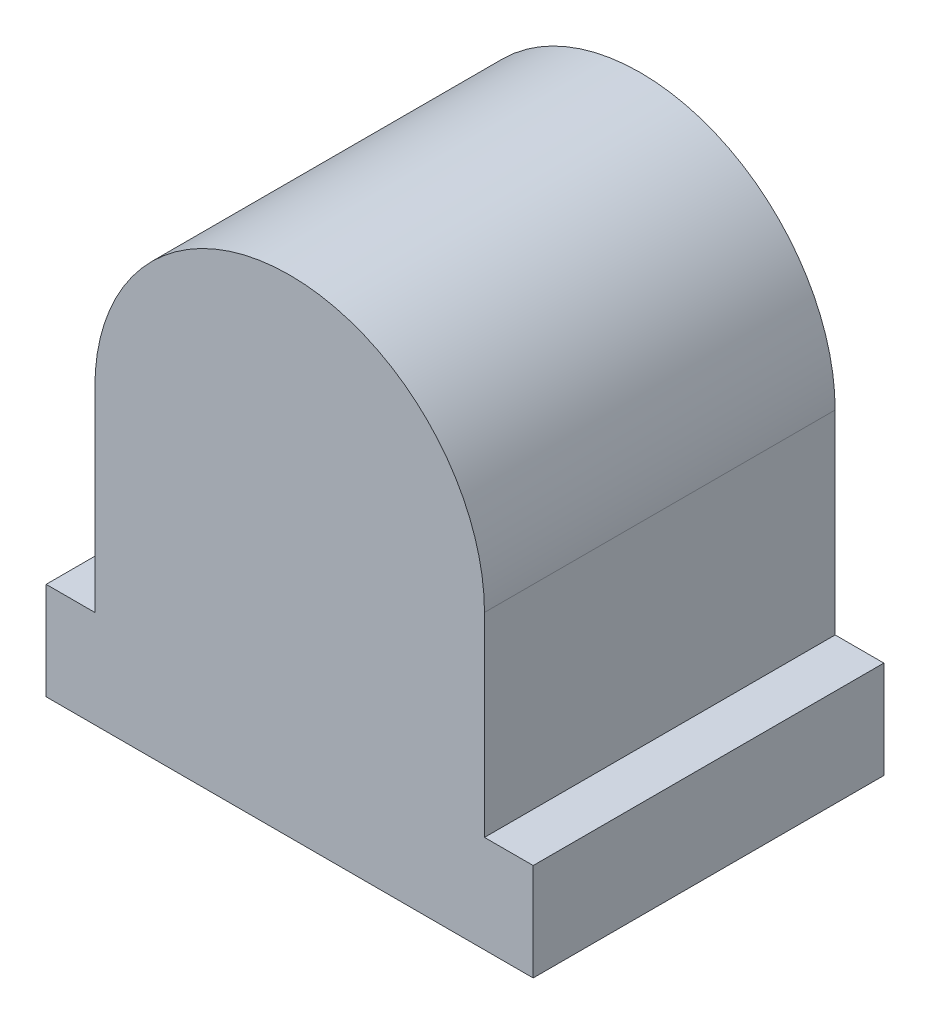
ISO-10303-21;
HEADER;
FILE_DESCRIPTION(('STEP AP214'),'2;1');
FILE_NAME('part.step','',(''),(''),'','','');
FILE_SCHEMA(('AUTOMOTIVE_DESIGN { 1 0 10303 214 1 1 1 1 }'));
ENDSEC;
DATA;
#1=APPLICATION_CONTEXT('core data for automotive mechanical design processes');
#2=APPLICATION_PROTOCOL_DEFINITION('international standard','automotive_design',2000,#1);
#3=PRODUCT_CONTEXT('',#1,'mechanical');
#4=PRODUCT('Part','Part','',(#3));
#5=PRODUCT_RELATED_PRODUCT_CATEGORY('part','',(#4));
#6=PRODUCT_DEFINITION_FORMATION('','',#4);
#7=PRODUCT_DEFINITION_CONTEXT('part definition',#1,'design');
#8=PRODUCT_DEFINITION('design','',#6,#7);
#9=PRODUCT_DEFINITION_SHAPE('','',#8);
#10=(LENGTH_UNIT() NAMED_UNIT(*) SI_UNIT(.MILLI.,.METRE.));
#11=(NAMED_UNIT(*) PLANE_ANGLE_UNIT() SI_UNIT($,.RADIAN.));
#12=(NAMED_UNIT(*) SI_UNIT($,.STERADIAN.) SOLID_ANGLE_UNIT());
#13=UNCERTAINTY_MEASURE_WITH_UNIT(LENGTH_MEASURE(1.E-05),#10,'distance_accuracy_value','');
#14=(GEOMETRIC_REPRESENTATION_CONTEXT(3) GLOBAL_UNCERTAINTY_ASSIGNED_CONTEXT((#13)) GLOBAL_UNIT_ASSIGNED_CONTEXT((#10,
#11,#12)) REPRESENTATION_CONTEXT('',''));
#15=CARTESIAN_POINT('',(0.,0.,0.));
#16=DIRECTION('',(0.,0.,1.));
#17=DIRECTION('',(1.,0.,0.));
#18=AXIS2_PLACEMENT_3D('',#15,#16,#17);
#19=CARTESIAN_POINT('',(0.,16.1907152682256,36.));
#20=DIRECTION('',(0.,0.,-1.));
#21=DIRECTION('',(-1.,0.,0.));
#22=AXIS2_PLACEMENT_3D('',#19,#20,#21);
#23=CYLINDRICAL_SURFACE('',#22,20.);
#24=CARTESIAN_POINT('',(0.,16.1907152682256,0.));
#25=DIRECTION('',(0.,0.,1.));
#26=DIRECTION('',(1.,0.,0.));
#27=AXIS2_PLACEMENT_3D('',#24,#25,#26);
#28=CIRCLE('',#27,20.);
#29=CARTESIAN_POINT('',(20.,16.1907152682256,0.));
#30=VERTEX_POINT('',#29);
#31=CARTESIAN_POINT('',(-20.,16.1907152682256,0.));
#32=VERTEX_POINT('',#31);
#33=EDGE_CURVE('E127',#30,#32,#28,.T.);
#34=ORIENTED_EDGE('',*,*,#33,.T.);
#35=DIRECTION('',(0.,0.,-1.));
#36=VECTOR('',#35,1.);
#37=CARTESIAN_POINT('',(-20.,16.1907152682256,36.));
#38=LINE('',#37,#36);
#39=CARTESIAN_POINT('',(-20.,16.1907152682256,36.));
#40=VERTEX_POINT('',#39);
#41=EDGE_CURVE('E11',#40,#32,#38,.T.);
#42=ORIENTED_EDGE('',*,*,#41,.F.);
#43=CARTESIAN_POINT('',(0.,16.1907152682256,36.));
#44=DIRECTION('',(0.,0.,1.));
#45=DIRECTION('',(1.,0.,0.));
#46=AXIS2_PLACEMENT_3D('',#43,#44,#45);
#47=CIRCLE('',#46,20.);
#48=CARTESIAN_POINT('',(20.,16.1907152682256,36.));
#49=VERTEX_POINT('',#48);
#50=EDGE_CURVE('E141',#49,#40,#47,.T.);
#51=ORIENTED_EDGE('',*,*,#50,.F.);
#52=DIRECTION('',(0.,0.,-1.));
#53=VECTOR('',#52,1.);
#54=CARTESIAN_POINT('',(20.,16.1907152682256,36.));
#55=LINE('',#54,#53);
#56=EDGE_CURVE('E123',#49,#30,#55,.T.);
#57=ORIENTED_EDGE('',*,*,#56,.T.);
#58=EDGE_LOOP('',(#34,#42,#51,#57));
#59=FACE_BOUND('',#58,.T.);
#60=ADVANCED_FACE('F31',(#59),#23,.T.);
#61=CARTESIAN_POINT('',(-20.,16.1907152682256,36.));
#62=DIRECTION('',(1.,0.,0.));
#63=DIRECTION('',(0.,1.,0.));
#64=AXIS2_PLACEMENT_3D('',#61,#62,#63);
#65=PLANE('',#64);
#66=DIRECTION('',(0.,-1.,0.));
#67=VECTOR('',#66,1.);
#68=CARTESIAN_POINT('',(-20.,16.1907152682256,0.));
#69=LINE('',#68,#67);
#70=CARTESIAN_POINT('',(-20.,-3.80928473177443,0.));
#71=VERTEX_POINT('',#70);
#72=EDGE_CURVE('E130',#32,#71,#69,.T.);
#73=ORIENTED_EDGE('',*,*,#72,.T.);
#74=DIRECTION('',(0.,0.,-1.));
#75=VECTOR('',#74,1.);
#76=CARTESIAN_POINT('',(-20.,-3.80928473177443,36.));
#77=LINE('',#76,#75);
#78=CARTESIAN_POINT('',(-20.,-3.80928473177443,36.));
#79=VERTEX_POINT('',#78);
#80=EDGE_CURVE('E39',#79,#71,#77,.T.);
#81=ORIENTED_EDGE('',*,*,#80,.F.);
#82=DIRECTION('',(0.,-1.,0.));
#83=VECTOR('',#82,1.);
#84=CARTESIAN_POINT('',(-20.,16.1907152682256,36.));
#85=LINE('',#84,#83);
#86=EDGE_CURVE('E90',#40,#79,#85,.T.);
#87=ORIENTED_EDGE('',*,*,#86,.F.);
#88=ORIENTED_EDGE('',*,*,#41,.T.);
#89=EDGE_LOOP('',(#73,#81,#87,#88));
#90=FACE_BOUND('',#89,.T.);
#91=ADVANCED_FACE('F176',(#90),#65,.F.);
#92=CARTESIAN_POINT('',(-20.,-3.80928473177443,36.));
#93=DIRECTION('',(0.,-1.,0.));
#94=DIRECTION('',(1.,0.,0.));
#95=AXIS2_PLACEMENT_3D('',#92,#93,#94);
#96=PLANE('',#95);
#97=DIRECTION('',(-1.,0.,0.));
#98=VECTOR('',#97,1.);
#99=CARTESIAN_POINT('',(-20.,-3.80928473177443,0.));
#100=LINE('',#99,#98);
#101=CARTESIAN_POINT('',(-25.,-3.80928473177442,0.));
#102=VERTEX_POINT('',#101);
#103=EDGE_CURVE('E132',#71,#102,#100,.T.);
#104=ORIENTED_EDGE('',*,*,#103,.T.);
#105=DIRECTION('',(0.,0.,-1.));
#106=VECTOR('',#105,1.);
#107=CARTESIAN_POINT('',(-25.,-3.80928473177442,36.));
#108=LINE('',#107,#106);
#109=CARTESIAN_POINT('',(-25.,-3.80928473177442,36.));
#110=VERTEX_POINT('',#109);
#111=EDGE_CURVE('E148',#110,#102,#108,.T.);
#112=ORIENTED_EDGE('',*,*,#111,.F.);
#113=DIRECTION('',(-1.,0.,0.));
#114=VECTOR('',#113,1.);
#115=CARTESIAN_POINT('',(-20.,-3.80928473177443,36.));
#116=LINE('',#115,#114);
#117=EDGE_CURVE('E156',#79,#110,#116,.T.);
#118=ORIENTED_EDGE('',*,*,#117,.F.);
#119=ORIENTED_EDGE('',*,*,#80,.T.);
#120=EDGE_LOOP('',(#104,#112,#118,#119));
#121=FACE_BOUND('',#120,.T.);
#122=ADVANCED_FACE('F154',(#121),#96,.F.);
#123=CARTESIAN_POINT('',(-25.,-3.80928473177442,36.));
#124=DIRECTION('',(1.,0.,0.));
#125=DIRECTION('',(0.,0.,-1.));
#126=AXIS2_PLACEMENT_3D('',#123,#124,#125);
#127=PLANE('',#126);
#128=DIRECTION('',(0.,-1.,0.));
#129=VECTOR('',#128,1.);
#130=CARTESIAN_POINT('',(-25.,-3.80928473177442,0.));
#131=LINE('',#130,#129);
#132=CARTESIAN_POINT('',(-25.,-13.8092847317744,0.));
#133=VERTEX_POINT('',#132);
#134=EDGE_CURVE('E134',#102,#133,#131,.T.);
#135=ORIENTED_EDGE('',*,*,#134,.T.);
#136=DIRECTION('',(0.,0.,-1.));
#137=VECTOR('',#136,1.);
#138=CARTESIAN_POINT('',(-25.,-13.8092847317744,36.));
#139=LINE('',#138,#137);
#140=CARTESIAN_POINT('',(-25.,-13.8092847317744,36.));
#141=VERTEX_POINT('',#140);
#142=EDGE_CURVE('E145',#141,#133,#139,.T.);
#143=ORIENTED_EDGE('',*,*,#142,.F.);
#144=DIRECTION('',(0.,-1.,0.));
#145=VECTOR('',#144,1.);
#146=CARTESIAN_POINT('',(-25.,-3.80928473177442,36.));
#147=LINE('',#146,#145);
#148=EDGE_CURVE('E168',#110,#141,#147,.T.);
#149=ORIENTED_EDGE('',*,*,#148,.F.);
#150=ORIENTED_EDGE('',*,*,#111,.T.);
#151=EDGE_LOOP('',(#135,#143,#149,#150));
#152=FACE_BOUND('',#151,.T.);
#153=ADVANCED_FACE('F164',(#152),#127,.F.);
#154=CARTESIAN_POINT('',(-25.,-13.8092847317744,36.));
#155=DIRECTION('',(0.,1.,0.));
#156=DIRECTION('',(0.,0.,1.));
#157=AXIS2_PLACEMENT_3D('',#154,#155,#156);
#158=PLANE('',#157);
#159=DIRECTION('',(1.,0.,0.));
#160=VECTOR('',#159,1.);
#161=CARTESIAN_POINT('',(-25.,-13.8092847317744,0.));
#162=LINE('',#161,#160);
#163=CARTESIAN_POINT('',(25.,-13.8092847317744,0.));
#164=VERTEX_POINT('',#163);
#165=EDGE_CURVE('E136',#133,#164,#162,.T.);
#166=ORIENTED_EDGE('',*,*,#165,.T.);
#167=DIRECTION('',(0.,0.,-1.));
#168=VECTOR('',#167,1.);
#169=CARTESIAN_POINT('',(25.,-13.8092847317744,36.));
#170=LINE('',#169,#168);
#171=CARTESIAN_POINT('',(25.,-13.8092847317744,36.));
#172=VERTEX_POINT('',#171);
#173=EDGE_CURVE('E118',#172,#164,#170,.T.);
#174=ORIENTED_EDGE('',*,*,#173,.F.);
#175=DIRECTION('',(1.,0.,0.));
#176=VECTOR('',#175,1.);
#177=CARTESIAN_POINT('',(-25.,-13.8092847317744,36.));
#178=LINE('',#177,#176);
#179=EDGE_CURVE('E109',#141,#172,#178,.T.);
#180=ORIENTED_EDGE('',*,*,#179,.F.);
#181=ORIENTED_EDGE('',*,*,#142,.T.);
#182=EDGE_LOOP('',(#166,#174,#180,#181));
#183=FACE_BOUND('',#182,.T.);
#184=ADVANCED_FACE('F167',(#183),#158,.F.);
#185=CARTESIAN_POINT('',(25.,-3.80928473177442,36.));
#186=DIRECTION('',(-1.,0.,0.));
#187=DIRECTION('',(0.,0.,1.));
#188=AXIS2_PLACEMENT_3D('',#185,#186,#187);
#189=PLANE('',#188);
#190=DIRECTION('',(0.,1.,0.));
#191=VECTOR('',#190,1.);
#192=CARTESIAN_POINT('',(25.,-3.80928473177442,0.));
#193=LINE('',#192,#191);
#194=CARTESIAN_POINT('',(25.,-3.80928473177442,0.));
#195=VERTEX_POINT('',#194);
#196=EDGE_CURVE('E117',#164,#195,#193,.T.);
#197=ORIENTED_EDGE('',*,*,#196,.T.);
#198=DIRECTION('',(0.,0.,-1.));
#199=VECTOR('',#198,1.);
#200=CARTESIAN_POINT('',(25.,-3.80928473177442,36.));
#201=LINE('',#200,#199);
#202=CARTESIAN_POINT('',(25.,-3.80928473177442,36.));
#203=VERTEX_POINT('',#202);
#204=EDGE_CURVE('E114',#203,#195,#201,.T.);
#205=ORIENTED_EDGE('',*,*,#204,.F.);
#206=DIRECTION('',(0.,1.,0.));
#207=VECTOR('',#206,1.);
#208=CARTESIAN_POINT('',(25.,-3.80928473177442,36.));
#209=LINE('',#208,#207);
#210=EDGE_CURVE('E103',#172,#203,#209,.T.);
#211=ORIENTED_EDGE('',*,*,#210,.F.);
#212=ORIENTED_EDGE('',*,*,#173,.T.);
#213=EDGE_LOOP('',(#197,#205,#211,#212));
#214=FACE_BOUND('',#213,.T.);
#215=ADVANCED_FACE('F115',(#214),#189,.F.);
#216=CARTESIAN_POINT('',(20.,-3.80928473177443,36.));
#217=DIRECTION('',(0.,-1.,0.));
#218=DIRECTION('',(1.,0.,0.));
#219=AXIS2_PLACEMENT_3D('',#216,#217,#218);
#220=PLANE('',#219);
#221=DIRECTION('',(-1.,0.,0.));
#222=VECTOR('',#221,1.);
#223=CARTESIAN_POINT('',(20.,-3.80928473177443,0.));
#224=LINE('',#223,#222);
#225=CARTESIAN_POINT('',(20.,-3.80928473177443,0.));
#226=VERTEX_POINT('',#225);
#227=EDGE_CURVE('E76',#195,#226,#224,.T.);
#228=ORIENTED_EDGE('',*,*,#227,.T.);
#229=DIRECTION('',(0.,0.,-1.));
#230=VECTOR('',#229,1.);
#231=CARTESIAN_POINT('',(20.,-3.80928473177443,36.));
#232=LINE('',#231,#230);
#233=CARTESIAN_POINT('',(20.,-3.80928473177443,36.));
#234=VERTEX_POINT('',#233);
#235=EDGE_CURVE('E119',#234,#226,#232,.T.);
#236=ORIENTED_EDGE('',*,*,#235,.F.);
#237=DIRECTION('',(-1.,0.,0.));
#238=VECTOR('',#237,1.);
#239=CARTESIAN_POINT('',(20.,-3.80928473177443,36.));
#240=LINE('',#239,#238);
#241=EDGE_CURVE('E107',#203,#234,#240,.T.);
#242=ORIENTED_EDGE('',*,*,#241,.F.);
#243=ORIENTED_EDGE('',*,*,#204,.T.);
#244=EDGE_LOOP('',(#228,#236,#242,#243));
#245=FACE_BOUND('',#244,.T.);
#246=ADVANCED_FACE('F121',(#245),#220,.F.);
#247=CARTESIAN_POINT('',(20.,16.1907152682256,36.));
#248=DIRECTION('',(-1.,0.,0.));
#249=DIRECTION('',(0.,-1.,0.));
#250=AXIS2_PLACEMENT_3D('',#247,#248,#249);
#251=PLANE('',#250);
#252=DIRECTION('',(0.,1.,0.));
#253=VECTOR('',#252,1.);
#254=CARTESIAN_POINT('',(20.,16.1907152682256,0.));
#255=LINE('',#254,#253);
#256=EDGE_CURVE('E82',#226,#30,#255,.T.);
#257=ORIENTED_EDGE('',*,*,#256,.T.);
#258=ORIENTED_EDGE('',*,*,#56,.F.);
#259=DIRECTION('',(0.,1.,0.));
#260=VECTOR('',#259,1.);
#261=CARTESIAN_POINT('',(20.,16.1907152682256,36.));
#262=LINE('',#261,#260);
#263=EDGE_CURVE('E47',#234,#49,#262,.T.);
#264=ORIENTED_EDGE('',*,*,#263,.F.);
#265=ORIENTED_EDGE('',*,*,#235,.T.);
#266=EDGE_LOOP('',(#257,#258,#264,#265));
#267=FACE_BOUND('',#266,.T.);
#268=ADVANCED_FACE('F192',(#267),#251,.F.);
#269=CARTESIAN_POINT('',(0.,16.1907152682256,36.));
#270=DIRECTION('',(0.,0.,1.));
#271=DIRECTION('',(1.,0.,0.));
#272=AXIS2_PLACEMENT_3D('',#269,#270,#271);
#273=PLANE('',#272);
#274=ORIENTED_EDGE('',*,*,#50,.T.);
#275=ORIENTED_EDGE('',*,*,#86,.T.);
#276=ORIENTED_EDGE('',*,*,#117,.T.);
#277=ORIENTED_EDGE('',*,*,#148,.T.);
#278=ORIENTED_EDGE('',*,*,#179,.T.);
#279=ORIENTED_EDGE('',*,*,#210,.T.);
#280=ORIENTED_EDGE('',*,*,#241,.T.);
#281=ORIENTED_EDGE('',*,*,#263,.T.);
#282=EDGE_LOOP('',(#274,#275,#276,#277,#278,#279,#280,#281));
#283=FACE_BOUND('',#282,.T.);
#284=ADVANCED_FACE('F105',(#283),#273,.T.);
#285=CARTESIAN_POINT('',(0.,16.1907152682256,0.));
#286=DIRECTION('',(0.,0.,1.));
#287=DIRECTION('',(1.,0.,0.));
#288=AXIS2_PLACEMENT_3D('',#285,#286,#287);
#289=PLANE('',#288);
#290=ORIENTED_EDGE('',*,*,#33,.F.);
#291=ORIENTED_EDGE('',*,*,#256,.F.);
#292=ORIENTED_EDGE('',*,*,#227,.F.);
#293=ORIENTED_EDGE('',*,*,#196,.F.);
#294=ORIENTED_EDGE('',*,*,#165,.F.);
#295=ORIENTED_EDGE('',*,*,#134,.F.);
#296=ORIENTED_EDGE('',*,*,#103,.F.);
#297=ORIENTED_EDGE('',*,*,#72,.F.);
#298=EDGE_LOOP('',(#290,#291,#292,#293,#294,#295,#296,#297));
#299=FACE_BOUND('',#298,.T.);
#300=ADVANCED_FACE('F160',(#299),#289,.F.);
#301=CLOSED_SHELL('',(#60,#91,#122,#153,#184,#215,#246,#268,#284,#300));
#302=MANIFOLD_SOLID_BREP('B2',#301);
#303=ADVANCED_BREP_SHAPE_REPRESENTATION('',(#18,#302),#14);
#304=SHAPE_DEFINITION_REPRESENTATION(#9,#303);
ENDSEC;
END-ISO-10303-21;
